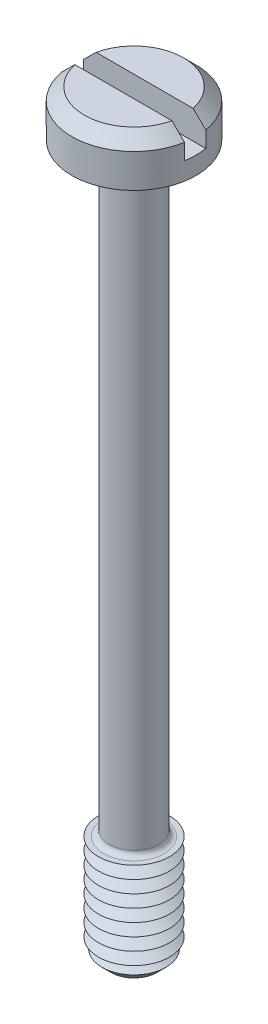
from build123d import *

# Parameters (mm, degrees)
SKETCH1_R           = 3.5
BOSS_EXTRUDE1_DEPTH = 2.6
SKETCH2_R           = 1.4
BOSS_EXTRUDE2_DEPTH = 40
SKETCH3_R           = 2
BOSS_EXTRUDE3_DEPTH = 6
CHAMFER1_SIZE       = 0.7
LPATTERN1_COUNT     = 8
LPATTERN1_PITCH     = 0.7
FILLET1_R           = 0.3
CHAMFER2_SIZE       = 0.7
SKETCH6_W           = 7
SKETCH6_H           = 1.2
CUT_EXTRUDE1_DEPTH  = 1.6


with BuildPart() as part:
    # Sketch1 → Boss-Extrude1 (new body)
    with BuildSketch(Plane(origin=(0, 0, 0), x_dir=(1, 0, 0), z_dir=(0, 1, 0))):
        with Locations(Location((0, 0, 0), (0, 0, 270))):
            Circle(SKETCH1_R)
    extrude(amount=BOSS_EXTRUDE1_DEPTH)

    # Sketch2 → Boss-Extrude2 (add)
    with BuildSketch(Plane.XZ):
        with Locations(Location((0, 0, 0), (0, 0, 270))):
            Circle(SKETCH2_R)
    extrude(amount=BOSS_EXTRUDE2_DEPTH)

    # Sketch3 → Boss-Extrude3 (add)
    with BuildSketch(Plane.XZ.offset(40)):
        with Locations(Location((0, 0, 0), (0, 0, 270))):
            Circle(SKETCH3_R)
    extrude(amount=-BOSS_EXTRUDE3_DEPTH)

    # Chamfer1
    chamfer1_edges = [part.edges().sort_by_distance(p)[0] for p in [
        (0, -40, 2),
    ]]
    chamfer(chamfer1_edges, length=CHAMFER1_SIZE)

    # Sketch5 → Cut-Revolve1 (revolve, cut)
    with BuildSketch(Plane(origin=(0, 0, 0), x_dir=(0, 0, -1), z_dir=(1, 0, 0))):
        Polygon((-2, -34), (-1.393782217, -34.35), (-2, -34.7), align=None)
    cut_revolve1 = revolve(axis=Axis((0, -6.58711856, 0), (0, -1, 0)), mode=Mode.SUBTRACT)

    # LPattern1: Cut-Revolve1 ×8
    with Locations(*[(0, -i * LPATTERN1_PITCH, 0) for i in range(1, LPATTERN1_COUNT)]):
        add(cut_revolve1, mode=Mode.SUBTRACT)

    # Fillet1
    fillet1_edges = [part.edges().sort_by_distance(p)[0] for p in [
        (0, 0, 1.4),
        (0, -34, 1.4),
    ]]
    fillet(fillet1_edges, radius=FILLET1_R)

    # Chamfer2
    chamfer2_edges = [part.edges().sort_by_distance(p)[0] for p in [
        (0, 2.6, -3.5),
    ]]
    chamfer(chamfer2_edges, length=CHAMFER2_SIZE)

    # Sketch6 → Cut-Extrude1 (cut)
    with BuildSketch(Plane(origin=(0, 2.6, 0), x_dir=(1, 0, 0), z_dir=(0, 1, 0))):
        Rectangle(SKETCH6_W, SKETCH6_H)
    extrude(amount=-CUT_EXTRUDE1_DEPTH, mode=Mode.SUBTRACT)


solid = part.part
